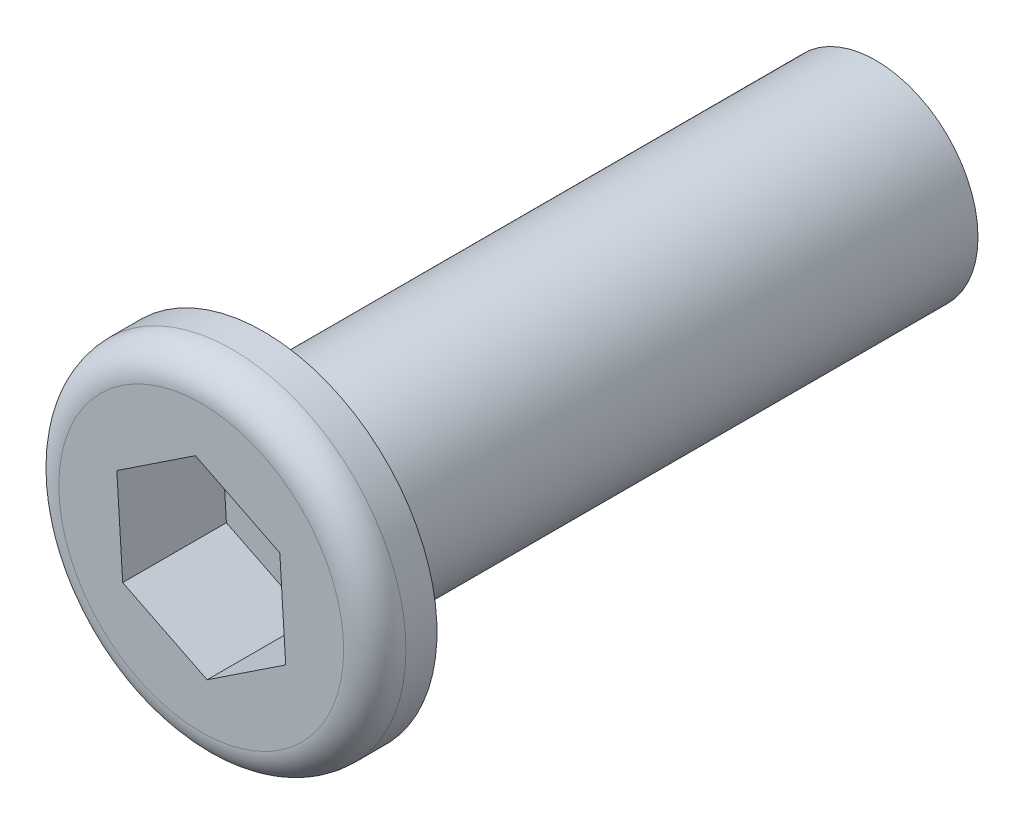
from build123d import *

# Parameters (mm, degrees)
SKETCH1_R           = 2.5
BOSS_EXTRUDE1_DEPTH = 15
SKETCH2_R           = 4.25
BOSS_EXTRUDE2_DEPTH = 1.524
CUT_EXTRUDE1_DEPTH  = 2.54
FILLET1_R           = 0.762


with BuildPart() as part:
    # Sketch1 → Boss-Extrude1 (new body)
    with BuildSketch(Plane.XY):
        Circle(SKETCH1_R)
    extrude(amount=BOSS_EXTRUDE1_DEPTH)

    # Sketch2 → Boss-Extrude2 (add)
    with BuildSketch(Plane.XY.offset(15)):
        with Locations(Location((0, 0, 0), (0, 0, 180))):
            Circle(SKETCH2_R)
    extrude(amount=BOSS_EXTRUDE2_DEPTH)

    # Sketch3 → Cut-Extrude1 (cut)
    with BuildSketch(Plane.XY.offset(16.524)):
        Polygon((2.068052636, -1.027857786), (1.924177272, 1.277057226), (-0.143875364, 2.304915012), (-2.068052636, 1.027857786), (-1.924177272, -1.277057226), (0.143875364, -2.304915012), align=None)
    extrude(amount=-CUT_EXTRUDE1_DEPTH, mode=Mode.SUBTRACT)

    # Fillet1
    fillet1_edges = [part.edges().sort_by_distance(p)[0] for p in [
        (4.25, 0, 16.524),
    ]]
    fillet(fillet1_edges, radius=FILLET1_R)


solid = part.part
